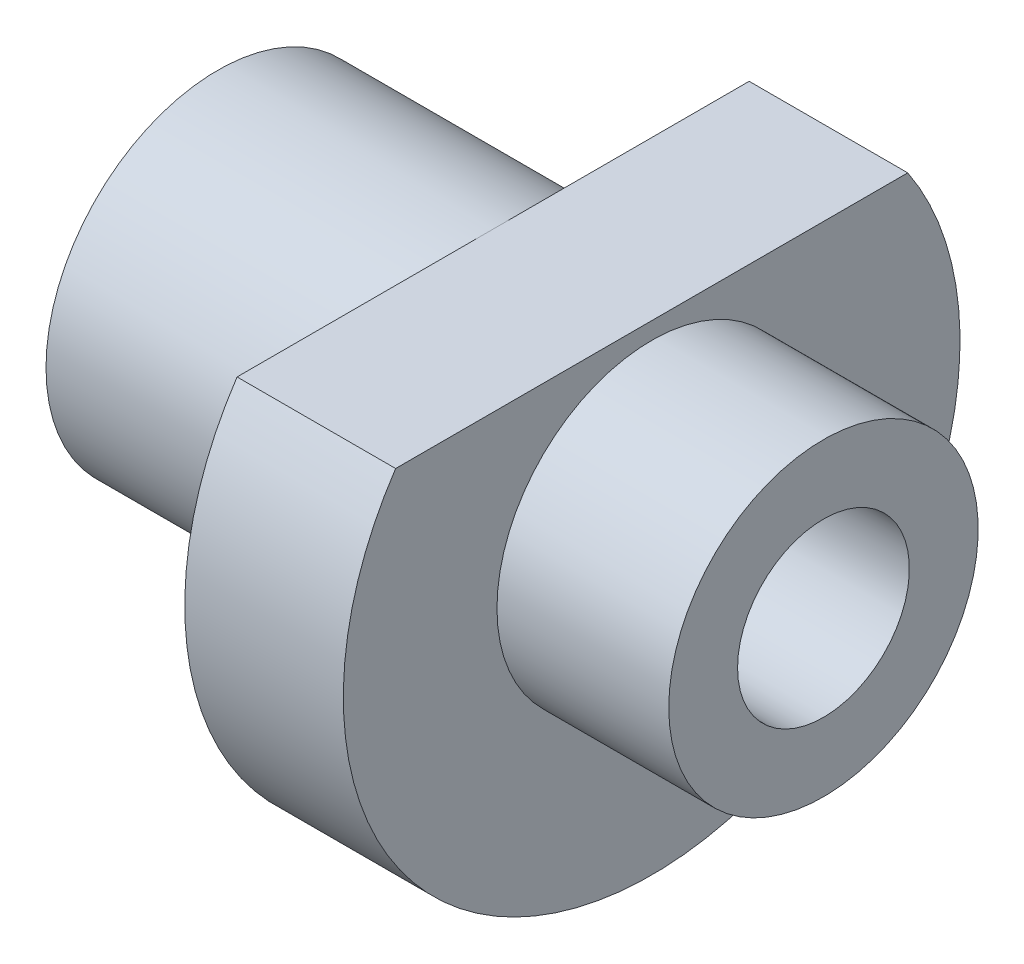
ISO-10303-21;
HEADER;
FILE_DESCRIPTION(('STEP AP214'),'2;1');
FILE_NAME('part.step','',(''),(''),'','','');
FILE_SCHEMA(('AUTOMOTIVE_DESIGN { 1 0 10303 214 1 1 1 1 }'));
ENDSEC;
DATA;
#1=APPLICATION_CONTEXT('core data for automotive mechanical design processes');
#2=APPLICATION_PROTOCOL_DEFINITION('international standard','automotive_design',2000,#1);
#3=PRODUCT_CONTEXT('',#1,'mechanical');
#4=PRODUCT('Part','Part','',(#3));
#5=PRODUCT_RELATED_PRODUCT_CATEGORY('part','',(#4));
#6=PRODUCT_DEFINITION_FORMATION('','',#4);
#7=PRODUCT_DEFINITION_CONTEXT('part definition',#1,'design');
#8=PRODUCT_DEFINITION('design','',#6,#7);
#9=PRODUCT_DEFINITION_SHAPE('','',#8);
#10=(LENGTH_UNIT() NAMED_UNIT(*) SI_UNIT(.MILLI.,.METRE.));
#11=(NAMED_UNIT(*) PLANE_ANGLE_UNIT() SI_UNIT($,.RADIAN.));
#12=(NAMED_UNIT(*) SI_UNIT($,.STERADIAN.) SOLID_ANGLE_UNIT());
#13=UNCERTAINTY_MEASURE_WITH_UNIT(LENGTH_MEASURE(1.E-05),#10,'distance_accuracy_value','');
#14=(GEOMETRIC_REPRESENTATION_CONTEXT(3) GLOBAL_UNCERTAINTY_ASSIGNED_CONTEXT((#13)) GLOBAL_UNIT_ASSIGNED_CONTEXT((#10,
#11,#12)) REPRESENTATION_CONTEXT('',''));
#15=CARTESIAN_POINT('',(0.,0.,0.));
#16=DIRECTION('',(0.,0.,1.));
#17=DIRECTION('',(1.,0.,0.));
#18=AXIS2_PLACEMENT_3D('',#15,#16,#17);
#19=CARTESIAN_POINT('',(-3.33066907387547E-13,0.,0.));
#20=DIRECTION('',(-1.,0.,0.));
#21=DIRECTION('',(0.,0.,0.999999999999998));
#22=AXIS2_PLACEMENT_3D('',#19,#20,#21);
#23=CYLINDRICAL_SURFACE('',#22,7.9248);
#24=CARTESIAN_POINT('',(-3.33066907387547E-13,0.,0.));
#25=DIRECTION('',(-1.,0.,0.));
#26=DIRECTION('',(0.,0.,0.999999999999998));
#27=AXIS2_PLACEMENT_3D('',#24,#25,#26);
#28=CIRCLE('',#27,7.9248);
#29=CARTESIAN_POINT('',(-3.32736971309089E-13,0.,7.92479999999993));
#30=VERTEX_POINT('',#29);
#31=EDGE_CURVE('E92',#30,#30,#28,.T.);
#32=ORIENTED_EDGE('',*,*,#31,.F.);
#33=EDGE_LOOP('',(#32));
#34=FACE_BOUND('',#33,.T.);
#35=CARTESIAN_POINT('',(12.6999999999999,0.,0.));
#36=DIRECTION('',(-1.,0.,0.));
#37=DIRECTION('',(0.,0.,0.999999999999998));
#38=AXIS2_PLACEMENT_3D('',#35,#36,#37);
#39=CIRCLE('',#38,7.9248);
#40=CARTESIAN_POINT('',(12.6999999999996,7.92480000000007,0.));
#41=VERTEX_POINT('',#40);
#42=EDGE_CURVE('E81',#41,#41,#39,.T.);
#43=ORIENTED_EDGE('',*,*,#42,.T.);
#44=EDGE_LOOP('',(#43));
#45=FACE_BOUND('',#44,.T.);
#46=ADVANCED_FACE('F34',(#34,#45),#23,.T.);
#47=CARTESIAN_POINT('',(4.44089209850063E-13,3.96240000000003,0.));
#48=DIRECTION('',(1.,0.,0.));
#49=DIRECTION('',(0.,0.,-0.999999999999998));
#50=AXIS2_PLACEMENT_3D('',#47,#48,#49);
#51=PLANE('',#50);
#52=CARTESIAN_POINT('',(-3.33066907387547E-13,0.,0.));
#53=DIRECTION('',(-1.,0.,0.));
#54=DIRECTION('',(0.,0.,0.999999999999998));
#55=AXIS2_PLACEMENT_3D('',#52,#53,#54);
#56=CIRCLE('',#55,3.9624);
#57=CARTESIAN_POINT('',(-3.32901939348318E-13,0.,3.96239999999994));
#58=VERTEX_POINT('',#57);
#59=EDGE_CURVE('E90',#58,#58,#56,.T.);
#60=ORIENTED_EDGE('',*,*,#59,.F.);
#61=EDGE_LOOP('',(#60));
#62=FACE_BOUND('',#61,.T.);
#63=ORIENTED_EDGE('',*,*,#31,.T.);
#64=EDGE_LOOP('',(#63));
#65=FACE_BOUND('',#64,.T.);
#66=ADVANCED_FACE('F103',(#62,#65),#51,.F.);
#67=CARTESIAN_POINT('',(-3.33066907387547E-13,0.,0.));
#68=DIRECTION('',(-1.,0.,0.));
#69=DIRECTION('',(0.,0.,0.999999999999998));
#70=AXIS2_PLACEMENT_3D('',#67,#68,#69);
#71=CYLINDRICAL_SURFACE('',#70,3.9624);
#72=CARTESIAN_POINT('',(27.9399999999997,0.,-2.28983498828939E-13));
#73=DIRECTION('',(-1.,0.,0.));
#74=DIRECTION('',(0.,0.,0.999999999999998));
#75=AXIS2_PLACEMENT_3D('',#72,#73,#74);
#76=CIRCLE('',#75,3.9624);
#77=CARTESIAN_POINT('',(27.9399999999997,0.,3.96239999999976));
#78=VERTEX_POINT('',#77);
#79=EDGE_CURVE('E87',#78,#78,#76,.T.);
#80=ORIENTED_EDGE('',*,*,#79,.F.);
#81=EDGE_LOOP('',(#80));
#82=FACE_BOUND('',#81,.T.);
#83=ORIENTED_EDGE('',*,*,#59,.T.);
#84=EDGE_LOOP('',(#83));
#85=FACE_BOUND('',#84,.T.);
#86=ADVANCED_FACE('F108',(#82,#85),#71,.F.);
#87=CARTESIAN_POINT('',(27.94,7.13740000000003,0.));
#88=DIRECTION('',(-1.,0.,0.));
#89=DIRECTION('',(0.,0.,0.999999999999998));
#90=AXIS2_PLACEMENT_3D('',#87,#88,#89);
#91=PLANE('',#90);
#92=CARTESIAN_POINT('',(27.9399999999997,0.,-2.28983498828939E-13));
#93=DIRECTION('',(-1.,0.,0.));
#94=DIRECTION('',(0.,0.,0.999999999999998));
#95=AXIS2_PLACEMENT_3D('',#92,#93,#94);
#96=CIRCLE('',#95,7.1374);
#97=CARTESIAN_POINT('',(27.9399999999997,0.,7.13739999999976));
#98=VERTEX_POINT('',#97);
#99=EDGE_CURVE('E79',#98,#98,#96,.T.);
#100=ORIENTED_EDGE('',*,*,#99,.F.);
#101=EDGE_LOOP('',(#100));
#102=FACE_BOUND('',#101,.T.);
#103=ORIENTED_EDGE('',*,*,#79,.T.);
#104=EDGE_LOOP('',(#103));
#105=FACE_BOUND('',#104,.T.);
#106=ADVANCED_FACE('F113',(#102,#105),#91,.F.);
#107=CARTESIAN_POINT('',(-3.33066907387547E-13,0.,0.));
#108=DIRECTION('',(-1.,0.,0.));
#109=DIRECTION('',(0.,0.,0.999999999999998));
#110=AXIS2_PLACEMENT_3D('',#107,#108,#109);
#111=CYLINDRICAL_SURFACE('',#110,7.1374);
#112=CARTESIAN_POINT('',(20.0151999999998,0.,0.));
#113=DIRECTION('',(-1.,0.,0.));
#114=DIRECTION('',(0.,0.,0.999999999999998));
#115=AXIS2_PLACEMENT_3D('',#112,#113,#114);
#116=CIRCLE('',#115,7.1374);
#117=CARTESIAN_POINT('',(20.0151999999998,0.,7.13739999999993));
#118=VERTEX_POINT('',#117);
#119=EDGE_CURVE('E75',#118,#118,#116,.T.);
#120=ORIENTED_EDGE('',*,*,#119,.F.);
#121=EDGE_LOOP('',(#120));
#122=FACE_BOUND('',#121,.T.);
#123=ORIENTED_EDGE('',*,*,#99,.T.);
#124=EDGE_LOOP('',(#123));
#125=FACE_BOUND('',#124,.T.);
#126=ADVANCED_FACE('F120',(#122,#125),#111,.T.);
#127=CARTESIAN_POINT('',(20.0152000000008,14.224,0.));
#128=DIRECTION('',(-1.,0.,0.));
#129=DIRECTION('',(0.,0.,0.999999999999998));
#130=AXIS2_PLACEMENT_3D('',#127,#128,#129);
#131=PLANE('',#130);
#132=CARTESIAN_POINT('',(20.0151999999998,0.,0.));
#133=DIRECTION('',(-1.,0.,0.));
#134=DIRECTION('',(0.,0.,0.999999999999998));
#135=AXIS2_PLACEMENT_3D('',#132,#133,#134);
#136=CIRCLE('',#135,14.224);
#137=CARTESIAN_POINT('',(20.0152,7.92480000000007,-11.8118466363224));
#138=VERTEX_POINT('',#137);
#139=CARTESIAN_POINT('',(20.0152000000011,7.9248,11.8118466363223));
#140=VERTEX_POINT('',#139);
#141=EDGE_CURVE('E72',#138,#140,#136,.T.);
#142=ORIENTED_EDGE('',*,*,#141,.F.);
#143=DIRECTION('',(0.,0.,-0.999999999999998));
#144=VECTOR('',#143,1.);
#145=CARTESIAN_POINT('',(20.0152000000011,7.9248,11.8118466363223));
#146=LINE('',#145,#144);
#147=EDGE_CURVE('E62',#140,#138,#146,.T.);
#148=ORIENTED_EDGE('',*,*,#147,.F.);
#149=EDGE_LOOP('',(#142,#148));
#150=FACE_BOUND('',#149,.T.);
#151=ORIENTED_EDGE('',*,*,#119,.T.);
#152=EDGE_LOOP('',(#151));
#153=FACE_BOUND('',#152,.T.);
#154=ADVANCED_FACE('F70',(#150,#153),#131,.F.);
#155=CARTESIAN_POINT('',(-3.33066907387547E-13,0.,0.));
#156=DIRECTION('',(-1.,0.,0.));
#157=DIRECTION('',(0.,0.,0.999999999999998));
#158=AXIS2_PLACEMENT_3D('',#155,#156,#157);
#159=CYLINDRICAL_SURFACE('',#158,14.224);
#160=ORIENTED_EDGE('',*,*,#141,.T.);
#161=DIRECTION('',(1.,0.,0.));
#162=VECTOR('',#161,1.);
#163=CARTESIAN_POINT('',(5.55111512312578E-13,7.92480000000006,11.8118466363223));
#164=LINE('',#163,#162);
#165=CARTESIAN_POINT('',(12.7000000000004,7.92480000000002,11.8118466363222));
#166=VERTEX_POINT('',#165);
#167=EDGE_CURVE('E59',#166,#140,#164,.T.);
#168=ORIENTED_EDGE('',*,*,#167,.F.);
#169=CARTESIAN_POINT('',(12.6999999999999,0.,0.));
#170=DIRECTION('',(-1.,0.,0.));
#171=DIRECTION('',(0.,0.,0.999999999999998));
#172=AXIS2_PLACEMENT_3D('',#169,#170,#171);
#173=CIRCLE('',#172,14.224);
#174=CARTESIAN_POINT('',(12.7000000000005,7.92480000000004,-11.8118466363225));
#175=VERTEX_POINT('',#174);
#176=EDGE_CURVE('E76',#175,#166,#173,.T.);
#177=ORIENTED_EDGE('',*,*,#176,.F.);
#178=DIRECTION('',(1.,0.,0.));
#179=VECTOR('',#178,1.);
#180=CARTESIAN_POINT('',(2.22044604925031E-13,7.92480000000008,-11.8118466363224));
#181=LINE('',#180,#179);
#182=EDGE_CURVE('E48',#175,#138,#181,.T.);
#183=ORIENTED_EDGE('',*,*,#182,.T.);
#184=EDGE_LOOP('',(#160,#168,#177,#183));
#185=FACE_BOUND('',#184,.T.);
#186=ADVANCED_FACE('F74',(#185),#159,.T.);
#187=CARTESIAN_POINT('',(12.6999999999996,7.92480000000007,0.));
#188=DIRECTION('',(1.,0.,0.));
#189=DIRECTION('',(0.,0.,-0.999999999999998));
#190=AXIS2_PLACEMENT_3D('',#187,#188,#189);
#191=PLANE('',#190);
#192=ORIENTED_EDGE('',*,*,#176,.T.);
#193=DIRECTION('',(0.,0.,-0.999999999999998));
#194=VECTOR('',#193,1.);
#195=CARTESIAN_POINT('',(12.6999999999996,7.92480000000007,0.));
#196=LINE('',#195,#194);
#197=EDGE_CURVE('E11',#166,#41,#196,.T.);
#198=ORIENTED_EDGE('',*,*,#197,.T.);
#199=ORIENTED_EDGE('',*,*,#42,.F.);
#200=EDGE_CURVE('E37',#41,#175,#196,.T.);
#201=ORIENTED_EDGE('',*,*,#200,.T.);
#202=EDGE_LOOP('',(#192,#198,#199,#201));
#203=FACE_BOUND('',#202,.T.);
#204=ADVANCED_FACE('F98',(#203),#191,.F.);
#205=CARTESIAN_POINT('',(5.55111512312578E-13,7.92480000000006,11.8118466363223));
#206=DIRECTION('',(0.,-1.,0.));
#207=DIRECTION('',(0.,0.,-0.999999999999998));
#208=AXIS2_PLACEMENT_3D('',#205,#206,#207);
#209=PLANE('',#208);
#210=ORIENTED_EDGE('',*,*,#167,.T.);
#211=ORIENTED_EDGE('',*,*,#147,.T.);
#212=ORIENTED_EDGE('',*,*,#182,.F.);
#213=ORIENTED_EDGE('',*,*,#200,.F.);
#214=ORIENTED_EDGE('',*,*,#197,.F.);
#215=EDGE_LOOP('',(#210,#211,#212,#213,#214));
#216=FACE_BOUND('',#215,.T.);
#217=ADVANCED_FACE('F61',(#216),#209,.F.);
#218=CLOSED_SHELL('',(#46,#66,#86,#106,#126,#154,#186,#204,#217));
#219=MANIFOLD_SOLID_BREP('B2',#218);
#220=ADVANCED_BREP_SHAPE_REPRESENTATION('',(#18,#219),#14);
#221=SHAPE_DEFINITION_REPRESENTATION(#9,#220);
ENDSEC;
END-ISO-10303-21;
